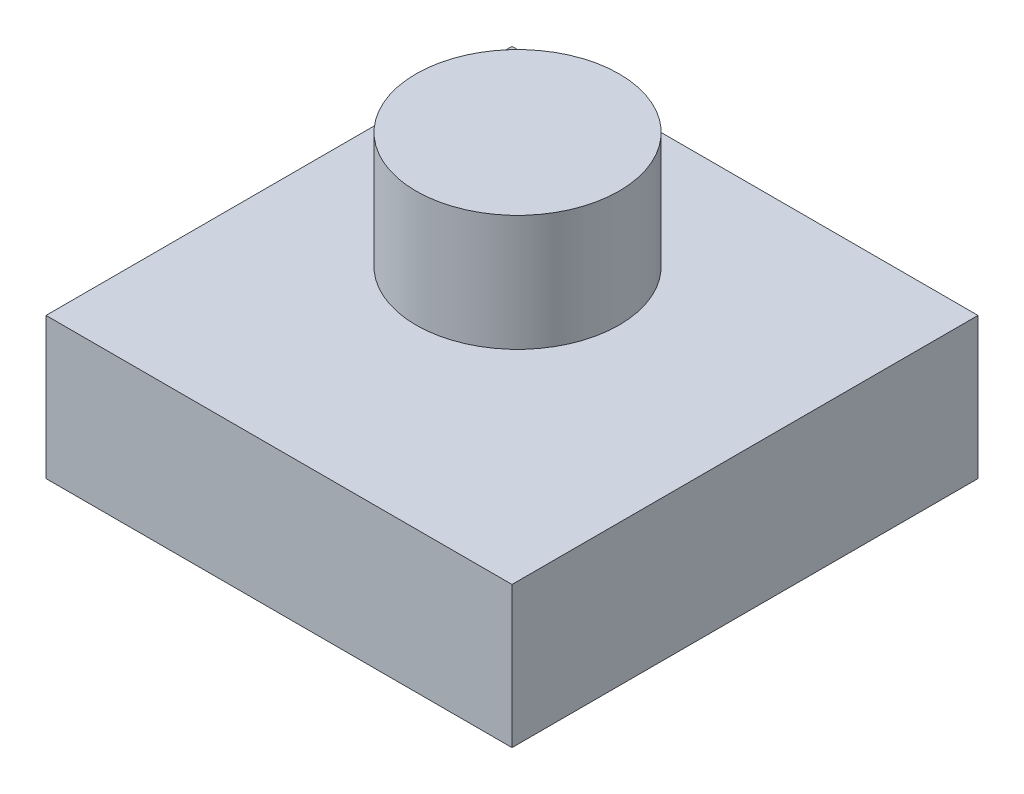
ISO-10303-21;
HEADER;
FILE_DESCRIPTION(('STEP AP214'),'2;1');
FILE_NAME('part.step','',(''),(''),'','','');
FILE_SCHEMA(('AUTOMOTIVE_DESIGN { 1 0 10303 214 1 1 1 1 }'));
ENDSEC;
DATA;
#1=APPLICATION_CONTEXT('core data for automotive mechanical design processes');
#2=APPLICATION_PROTOCOL_DEFINITION('international standard','automotive_design',2000,#1);
#3=PRODUCT_CONTEXT('',#1,'mechanical');
#4=PRODUCT('Part','Part','',(#3));
#5=PRODUCT_RELATED_PRODUCT_CATEGORY('part','',(#4));
#6=PRODUCT_DEFINITION_FORMATION('','',#4);
#7=PRODUCT_DEFINITION_CONTEXT('part definition',#1,'design');
#8=PRODUCT_DEFINITION('design','',#6,#7);
#9=PRODUCT_DEFINITION_SHAPE('','',#8);
#10=(LENGTH_UNIT() NAMED_UNIT(*) SI_UNIT(.MILLI.,.METRE.));
#11=(NAMED_UNIT(*) PLANE_ANGLE_UNIT() SI_UNIT($,.RADIAN.));
#12=(NAMED_UNIT(*) SI_UNIT($,.STERADIAN.) SOLID_ANGLE_UNIT());
#13=UNCERTAINTY_MEASURE_WITH_UNIT(LENGTH_MEASURE(1.E-05),#10,'distance_accuracy_value','');
#14=(GEOMETRIC_REPRESENTATION_CONTEXT(3) GLOBAL_UNCERTAINTY_ASSIGNED_CONTEXT((#13)) GLOBAL_UNIT_ASSIGNED_CONTEXT((#10,
#11,#12)) REPRESENTATION_CONTEXT('',''));
#15=CARTESIAN_POINT('',(0.,0.,0.));
#16=DIRECTION('',(0.,0.,1.));
#17=DIRECTION('',(1.,0.,0.));
#18=AXIS2_PLACEMENT_3D('',#15,#16,#17);
#19=CARTESIAN_POINT('',(-48.7636206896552,29.5774718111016,48.7636206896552));
#20=DIRECTION('',(0.,1.,0.));
#21=DIRECTION('',(0.,0.,1.));
#22=AXIS2_PLACEMENT_3D('',#19,#20,#21);
#23=PLANE('',#22);
#24=DIRECTION('',(0.,0.,1.));
#25=VECTOR('',#24,1.);
#26=CARTESIAN_POINT('',(-48.7636206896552,29.5774718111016,-48.7636206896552));
#27=LINE('',#26,#25);
#28=CARTESIAN_POINT('',(-48.7636206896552,29.5774718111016,-48.7636206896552));
#29=VERTEX_POINT('',#28);
#30=CARTESIAN_POINT('',(-48.7636206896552,29.5774718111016,48.7636206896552));
#31=VERTEX_POINT('',#30);
#32=EDGE_CURVE('E84',#29,#31,#27,.T.);
#33=ORIENTED_EDGE('',*,*,#32,.T.);
#34=DIRECTION('',(1.,0.,0.));
#35=VECTOR('',#34,1.);
#36=CARTESIAN_POINT('',(-48.7636206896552,29.5774718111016,48.7636206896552));
#37=LINE('',#36,#35);
#38=CARTESIAN_POINT('',(48.7636206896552,29.5774718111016,48.7636206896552));
#39=VERTEX_POINT('',#38);
#40=EDGE_CURVE('E79',#31,#39,#37,.T.);
#41=ORIENTED_EDGE('',*,*,#40,.T.);
#42=DIRECTION('',(0.,0.,-1.));
#43=VECTOR('',#42,1.);
#44=CARTESIAN_POINT('',(48.7636206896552,29.5774718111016,-48.7636206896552));
#45=LINE('',#44,#43);
#46=CARTESIAN_POINT('',(48.7636206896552,29.5774718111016,-48.7636206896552));
#47=VERTEX_POINT('',#46);
#48=EDGE_CURVE('E82',#39,#47,#45,.T.);
#49=ORIENTED_EDGE('',*,*,#48,.T.);
#50=DIRECTION('',(-1.,0.,0.));
#51=VECTOR('',#50,1.);
#52=CARTESIAN_POINT('',(-48.7636206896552,29.5774718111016,-48.7636206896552));
#53=LINE('',#52,#51);
#54=EDGE_CURVE('E49',#47,#29,#53,.T.);
#55=ORIENTED_EDGE('',*,*,#54,.T.);
#56=EDGE_LOOP('',(#33,#41,#49,#55));
#57=FACE_BOUND('',#56,.T.);
#58=CARTESIAN_POINT('',(-8.2832576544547,29.5774718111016,-9.45298710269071));
#59=DIRECTION('',(0.,1.,0.));
#60=DIRECTION('',(0.,0.,1.));
#61=AXIS2_PLACEMENT_3D('',#58,#59,#60);
#62=CIRCLE('',#61,21.2535914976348);
#63=CARTESIAN_POINT('',(-8.2832576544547,29.5774718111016,11.8006043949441));
#64=VERTEX_POINT('',#63);
#65=EDGE_CURVE('E110',#64,#64,#62,.T.);
#66=ORIENTED_EDGE('',*,*,#65,.F.);
#67=EDGE_LOOP('',(#66));
#68=FACE_BOUND('',#67,.T.);
#69=ADVANCED_FACE('F32',(#57,#68),#23,.T.);
#70=CARTESIAN_POINT('',(-48.7636206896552,29.5774718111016,-48.7636206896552));
#71=DIRECTION('',(1.,0.,0.));
#72=DIRECTION('',(0.,0.,-1.));
#73=AXIS2_PLACEMENT_3D('',#70,#71,#72);
#74=PLANE('',#73);
#75=DIRECTION('',(0.,0.,1.));
#76=VECTOR('',#75,1.);
#77=CARTESIAN_POINT('',(-48.7636206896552,0.,-48.7636206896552));
#78=LINE('',#77,#76);
#79=CARTESIAN_POINT('',(-48.7636206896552,0.,-48.7636206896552));
#80=VERTEX_POINT('',#79);
#81=CARTESIAN_POINT('',(-48.7636206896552,0.,48.7636206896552));
#82=VERTEX_POINT('',#81);
#83=EDGE_CURVE('E96',#80,#82,#78,.T.);
#84=ORIENTED_EDGE('',*,*,#83,.T.);
#85=DIRECTION('',(0.,-1.,0.));
#86=VECTOR('',#85,1.);
#87=CARTESIAN_POINT('',(-48.7636206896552,29.5774718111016,48.7636206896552));
#88=LINE('',#87,#86);
#89=EDGE_CURVE('E11',#31,#82,#88,.T.);
#90=ORIENTED_EDGE('',*,*,#89,.F.);
#91=ORIENTED_EDGE('',*,*,#32,.F.);
#92=DIRECTION('',(0.,-1.,0.));
#93=VECTOR('',#92,1.);
#94=CARTESIAN_POINT('',(-48.7636206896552,29.5774718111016,-48.7636206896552));
#95=LINE('',#94,#93);
#96=EDGE_CURVE('E92',#29,#80,#95,.T.);
#97=ORIENTED_EDGE('',*,*,#96,.T.);
#98=EDGE_LOOP('',(#84,#90,#91,#97));
#99=FACE_BOUND('',#98,.T.);
#100=ADVANCED_FACE('F34',(#99),#74,.F.);
#101=CARTESIAN_POINT('',(-48.7636206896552,29.5774718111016,48.7636206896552));
#102=DIRECTION('',(0.,0.,-1.));
#103=DIRECTION('',(-1.,0.,0.));
#104=AXIS2_PLACEMENT_3D('',#101,#102,#103);
#105=PLANE('',#104);
#106=DIRECTION('',(1.,0.,0.));
#107=VECTOR('',#106,1.);
#108=CARTESIAN_POINT('',(-48.7636206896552,0.,48.7636206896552));
#109=LINE('',#108,#107);
#110=CARTESIAN_POINT('',(48.7636206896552,0.,48.7636206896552));
#111=VERTEX_POINT('',#110);
#112=EDGE_CURVE('E88',#82,#111,#109,.T.);
#113=ORIENTED_EDGE('',*,*,#112,.T.);
#114=DIRECTION('',(0.,-1.,0.));
#115=VECTOR('',#114,1.);
#116=CARTESIAN_POINT('',(48.7636206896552,29.5774718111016,48.7636206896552));
#117=LINE('',#116,#115);
#118=EDGE_CURVE('E41',#39,#111,#117,.T.);
#119=ORIENTED_EDGE('',*,*,#118,.F.);
#120=ORIENTED_EDGE('',*,*,#40,.F.);
#121=ORIENTED_EDGE('',*,*,#89,.T.);
#122=EDGE_LOOP('',(#113,#119,#120,#121));
#123=FACE_BOUND('',#122,.T.);
#124=ADVANCED_FACE('F87',(#123),#105,.F.);
#125=CARTESIAN_POINT('',(48.7636206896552,29.5774718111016,-48.7636206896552));
#126=DIRECTION('',(-1.,0.,0.));
#127=DIRECTION('',(0.,0.,1.));
#128=AXIS2_PLACEMENT_3D('',#125,#126,#127);
#129=PLANE('',#128);
#130=DIRECTION('',(0.,0.,-1.));
#131=VECTOR('',#130,1.);
#132=CARTESIAN_POINT('',(48.7636206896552,0.,-48.7636206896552));
#133=LINE('',#132,#131);
#134=CARTESIAN_POINT('',(48.7636206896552,0.,-48.7636206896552));
#135=VERTEX_POINT('',#134);
#136=EDGE_CURVE('E66',#111,#135,#133,.T.);
#137=ORIENTED_EDGE('',*,*,#136,.T.);
#138=DIRECTION('',(0.,-1.,0.));
#139=VECTOR('',#138,1.);
#140=CARTESIAN_POINT('',(48.7636206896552,29.5774718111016,-48.7636206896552));
#141=LINE('',#140,#139);
#142=EDGE_CURVE('E89',#47,#135,#141,.T.);
#143=ORIENTED_EDGE('',*,*,#142,.F.);
#144=ORIENTED_EDGE('',*,*,#48,.F.);
#145=ORIENTED_EDGE('',*,*,#118,.T.);
#146=EDGE_LOOP('',(#137,#143,#144,#145));
#147=FACE_BOUND('',#146,.T.);
#148=ADVANCED_FACE('F90',(#147),#129,.F.);
#149=CARTESIAN_POINT('',(-48.7636206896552,29.5774718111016,-48.7636206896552));
#150=DIRECTION('',(0.,0.,1.));
#151=DIRECTION('',(1.,0.,0.));
#152=AXIS2_PLACEMENT_3D('',#149,#150,#151);
#153=PLANE('',#152);
#154=DIRECTION('',(-1.,0.,0.));
#155=VECTOR('',#154,1.);
#156=CARTESIAN_POINT('',(-48.7636206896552,0.,-48.7636206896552));
#157=LINE('',#156,#155);
#158=EDGE_CURVE('E72',#135,#80,#157,.T.);
#159=ORIENTED_EDGE('',*,*,#158,.T.);
#160=ORIENTED_EDGE('',*,*,#96,.F.);
#161=ORIENTED_EDGE('',*,*,#54,.F.);
#162=ORIENTED_EDGE('',*,*,#142,.T.);
#163=EDGE_LOOP('',(#159,#160,#161,#162));
#164=FACE_BOUND('',#163,.T.);
#165=ADVANCED_FACE('F104',(#164),#153,.F.);
#166=CARTESIAN_POINT('',(-48.7636206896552,0.,48.7636206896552));
#167=DIRECTION('',(0.,1.,0.));
#168=DIRECTION('',(0.,0.,1.));
#169=AXIS2_PLACEMENT_3D('',#166,#167,#168);
#170=PLANE('',#169);
#171=ORIENTED_EDGE('',*,*,#83,.F.);
#172=ORIENTED_EDGE('',*,*,#158,.F.);
#173=ORIENTED_EDGE('',*,*,#136,.F.);
#174=ORIENTED_EDGE('',*,*,#112,.F.);
#175=EDGE_LOOP('',(#171,#172,#173,#174));
#176=FACE_BOUND('',#175,.T.);
#177=ADVANCED_FACE('F107',(#176),#170,.F.);
#178=CARTESIAN_POINT('',(-8.2832576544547,53.8679924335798,-9.45298710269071));
#179=DIRECTION('',(0.,-1.,0.));
#180=DIRECTION('',(0.,0.,-1.));
#181=AXIS2_PLACEMENT_3D('',#178,#179,#180);
#182=CYLINDRICAL_SURFACE('',#181,21.2535914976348);
#183=CARTESIAN_POINT('',(-8.2832576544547,53.8679924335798,-9.45298710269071));
#184=DIRECTION('',(0.,1.,0.));
#185=DIRECTION('',(0.,0.,1.));
#186=AXIS2_PLACEMENT_3D('',#183,#184,#185);
#187=CIRCLE('',#186,21.2535914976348);
#188=CARTESIAN_POINT('',(-8.2832576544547,53.8679924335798,11.8006043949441));
#189=VERTEX_POINT('',#188);
#190=EDGE_CURVE('E99',#189,#189,#187,.T.);
#191=ORIENTED_EDGE('',*,*,#190,.F.);
#192=EDGE_LOOP('',(#191));
#193=FACE_BOUND('',#192,.T.);
#194=ORIENTED_EDGE('',*,*,#65,.T.);
#195=EDGE_LOOP('',(#194));
#196=FACE_BOUND('',#195,.T.);
#197=ADVANCED_FACE('F118',(#193,#196),#182,.T.);
#198=CARTESIAN_POINT('',(-8.2832576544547,53.8679924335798,-9.45298710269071));
#199=DIRECTION('',(0.,1.,0.));
#200=DIRECTION('',(0.,0.,1.));
#201=AXIS2_PLACEMENT_3D('',#198,#199,#200);
#202=PLANE('',#201);
#203=ORIENTED_EDGE('',*,*,#190,.T.);
#204=EDGE_LOOP('',(#203));
#205=FACE_BOUND('',#204,.T.);
#206=ADVANCED_FACE('F116',(#205),#202,.T.);
#207=CLOSED_SHELL('',(#69,#100,#124,#148,#165,#177,#197,#206));
#208=MANIFOLD_SOLID_BREP('B2',#207);
#209=ADVANCED_BREP_SHAPE_REPRESENTATION('',(#18,#208),#14);
#210=SHAPE_DEFINITION_REPRESENTATION(#9,#209);
ENDSEC;
END-ISO-10303-21;
